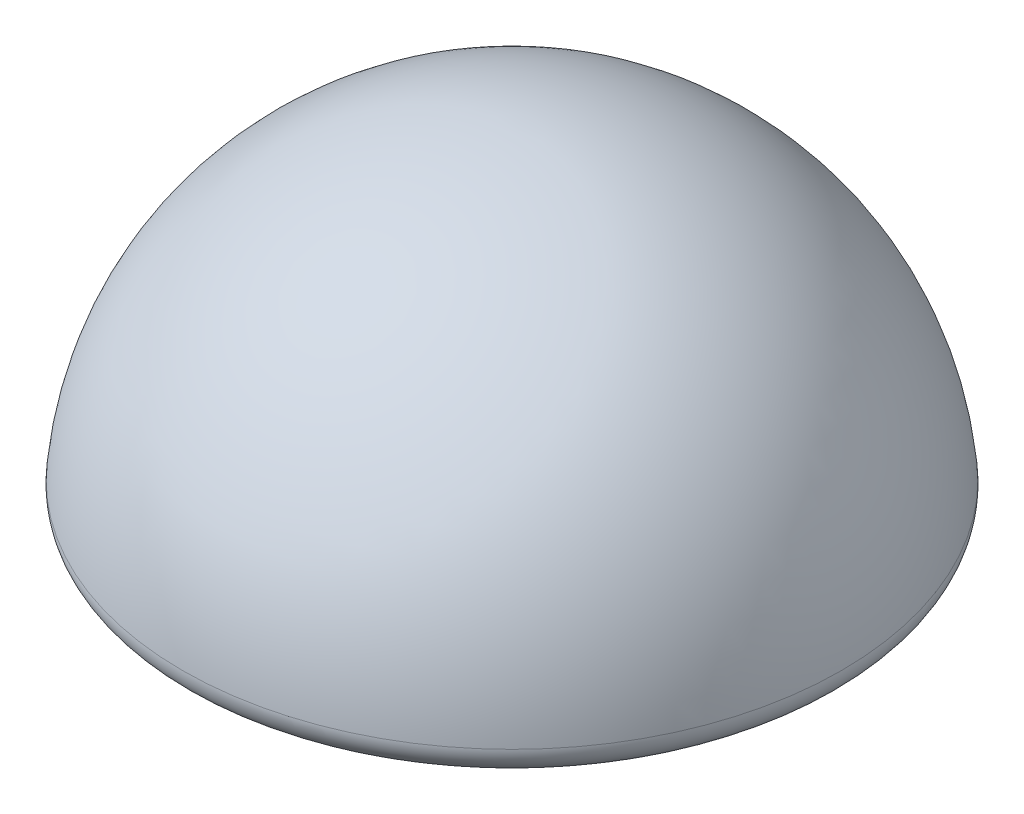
from build123d import *

# Parameters (mm, degrees)
SKETCH2_R          = 12.25
CUT_EXTRUDE1_DEPTH = 16
FILLET2_R          = 2


with BuildPart() as part:
    # Sketch1 → Revolve1 (revolve)
    with BuildSketch(Plane.XY):
        with BuildLine():
            Line((0, 0), (0, 25))
            ThreePointArc((0, 25), (17.67766953, 17.67766953), (25, 0))
            Line((25, 0), (0, 0))
        make_face()
    revolve(axis=Axis((0, 0, 0), (0, 1, 0)))

    # Sketch2 → Cut-Extrude1 (cut)
    with BuildSketch(Plane.XZ):
        with Locations(Location((0, 0, 0), (0, 0, 270))):
            Circle(SKETCH2_R)
    extrude(amount=-CUT_EXTRUDE1_DEPTH, mode=Mode.SUBTRACT)

    # Fillet2
    fillet2_edges = [part.edges().sort_by_distance(p)[0] for p in [
        (-25, 0, 0),
    ]]
    fillet(fillet2_edges, radius=FILLET2_R)


solid = part.part
